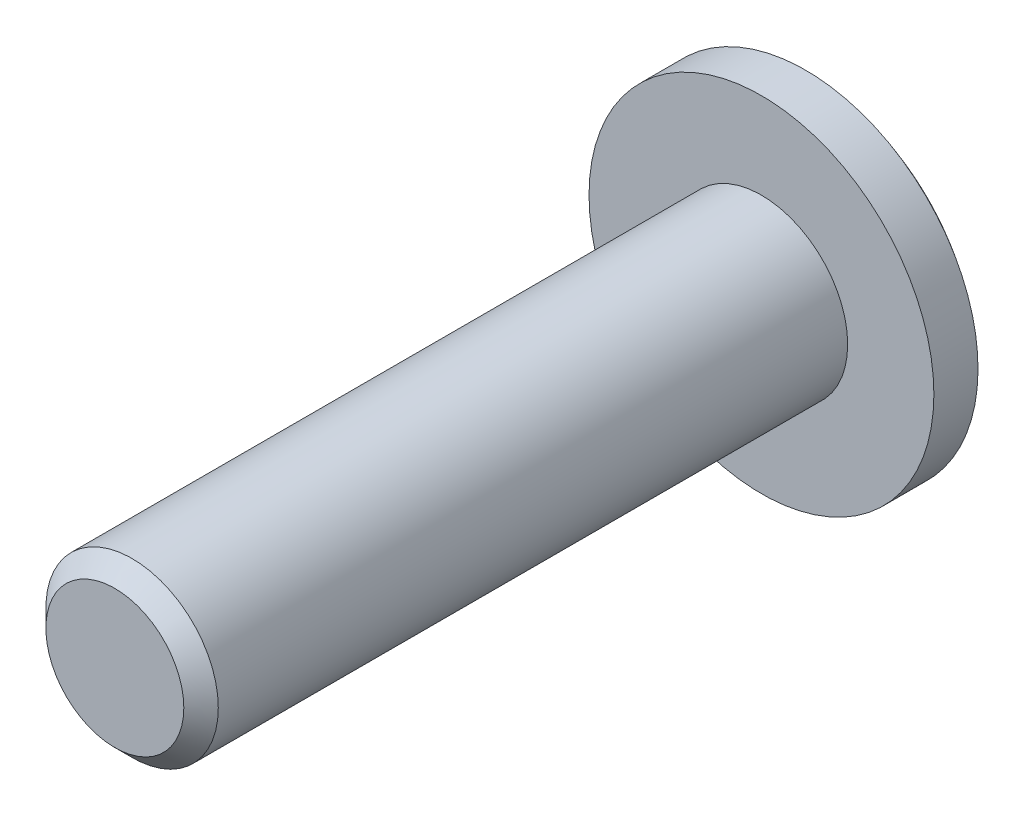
ISO-10303-21;
HEADER;
FILE_DESCRIPTION(('STEP AP214'),'2;1');
FILE_NAME('part.step','',(''),(''),'','','');
FILE_SCHEMA(('AUTOMOTIVE_DESIGN { 1 0 10303 214 1 1 1 1 }'));
ENDSEC;
DATA;
#1=APPLICATION_CONTEXT('core data for automotive mechanical design processes');
#2=APPLICATION_PROTOCOL_DEFINITION('international standard','automotive_design',2000,#1);
#3=PRODUCT_CONTEXT('',#1,'mechanical');
#4=PRODUCT('Part','Part','',(#3));
#5=PRODUCT_RELATED_PRODUCT_CATEGORY('part','',(#4));
#6=PRODUCT_DEFINITION_FORMATION('','',#4);
#7=PRODUCT_DEFINITION_CONTEXT('part definition',#1,'design');
#8=PRODUCT_DEFINITION('design','',#6,#7);
#9=PRODUCT_DEFINITION_SHAPE('','',#8);
#10=(LENGTH_UNIT() NAMED_UNIT(*) SI_UNIT(.MILLI.,.METRE.));
#11=(NAMED_UNIT(*) PLANE_ANGLE_UNIT() SI_UNIT($,.RADIAN.));
#12=(NAMED_UNIT(*) SI_UNIT($,.STERADIAN.) SOLID_ANGLE_UNIT());
#13=UNCERTAINTY_MEASURE_WITH_UNIT(LENGTH_MEASURE(1.E-05),#10,'distance_accuracy_value','');
#14=(GEOMETRIC_REPRESENTATION_CONTEXT(3) GLOBAL_UNCERTAINTY_ASSIGNED_CONTEXT((#13)) GLOBAL_UNIT_ASSIGNED_CONTEXT((#10,
#11,#12)) REPRESENTATION_CONTEXT('',''));
#15=CARTESIAN_POINT('',(0.,0.,0.));
#16=DIRECTION('',(0.,0.,1.));
#17=DIRECTION('',(1.,0.,0.));
#18=AXIS2_PLACEMENT_3D('',#15,#16,#17);
#19=CARTESIAN_POINT('',(0.,0.,8.2));
#20=DIRECTION('',(0.,0.,-1.));
#21=DIRECTION('',(1.,0.,0.));
#22=AXIS2_PLACEMENT_3D('',#19,#20,#21);
#23=SPHERICAL_SURFACE('',#22,13.);
#24=CARTESIAN_POINT('',(0.,0.,-2.0469507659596));
#25=DIRECTION('',(0.,0.,-1.));
#26=DIRECTION('',(-1.,0.,0.));
#27=AXIS2_PLACEMENT_3D('',#24,#25,#26);
#28=CIRCLE('',#27,8.);
#29=CARTESIAN_POINT('',(-8.,0.,-2.0469507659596));
#30=VERTEX_POINT('',#29);
#31=EDGE_CURVE('E109',#30,#30,#28,.T.);
#32=ORIENTED_EDGE('',*,*,#31,.T.);
#33=EDGE_LOOP('',(#32));
#34=FACE_BOUND('',#33,.T.);
#35=CARTESIAN_POINT('',(1.75,3.03108891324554,8.2));
#36=DIRECTION('',(-0.5,-0.866025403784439,0.));
#37=DIRECTION('',(0.866025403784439,-0.5,0.));
#38=AXIS2_PLACEMENT_3D('',#35,#36,#37);
#39=CIRCLE('',#38,12.5199840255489);
#40=CARTESIAN_POINT('',(0.,4.04145188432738,-4.15583532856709));
#41=VERTEX_POINT('',#40);
#42=CARTESIAN_POINT('',(3.5,2.02072594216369,-4.15583532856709));
#43=VERTEX_POINT('',#42);
#44=EDGE_CURVE('E126',#41,#43,#39,.T.);
#45=ORIENTED_EDGE('',*,*,#44,.F.);
#46=CARTESIAN_POINT('',(-1.75,3.03108891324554,8.2));
#47=DIRECTION('',(0.5,-0.866025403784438,0.));
#48=DIRECTION('',(0.866025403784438,0.5,0.));
#49=AXIS2_PLACEMENT_3D('',#46,#47,#48);
#50=CIRCLE('',#49,12.5199840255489);
#51=CARTESIAN_POINT('',(-3.5,2.02072594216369,-4.15583532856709));
#52=VERTEX_POINT('',#51);
#53=EDGE_CURVE('E57',#52,#41,#50,.T.);
#54=ORIENTED_EDGE('',*,*,#53,.F.);
#55=CARTESIAN_POINT('',(-3.5,0.,8.2));
#56=DIRECTION('',(1.,0.,0.));
#57=DIRECTION('',(0.,1.,0.));
#58=AXIS2_PLACEMENT_3D('',#55,#56,#57);
#59=CIRCLE('',#58,12.5199840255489);
#60=CARTESIAN_POINT('',(-3.5,-2.02072594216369,-4.15583532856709));
#61=VERTEX_POINT('',#60);
#62=EDGE_CURVE('E123',#61,#52,#59,.T.);
#63=ORIENTED_EDGE('',*,*,#62,.F.);
#64=CARTESIAN_POINT('',(-1.75,-3.03108891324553,8.2));
#65=DIRECTION('',(0.5,0.866025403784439,0.));
#66=DIRECTION('',(-0.866025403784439,0.5,0.));
#67=AXIS2_PLACEMENT_3D('',#64,#65,#66);
#68=CIRCLE('',#67,12.5199840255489);
#69=CARTESIAN_POINT('',(0.,-4.04145188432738,-4.15583532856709));
#70=VERTEX_POINT('',#69);
#71=EDGE_CURVE('E121',#70,#61,#68,.T.);
#72=ORIENTED_EDGE('',*,*,#71,.F.);
#73=CARTESIAN_POINT('',(1.75,-3.03108891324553,8.2));
#74=DIRECTION('',(-0.5,0.866025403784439,0.));
#75=DIRECTION('',(-0.866025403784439,-0.5,0.));
#76=AXIS2_PLACEMENT_3D('',#73,#74,#75);
#77=CIRCLE('',#76,12.5199840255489);
#78=CARTESIAN_POINT('',(3.5,-2.02072594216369,-4.15583532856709));
#79=VERTEX_POINT('',#78);
#80=EDGE_CURVE('E119',#79,#70,#77,.T.);
#81=ORIENTED_EDGE('',*,*,#80,.F.);
#82=CARTESIAN_POINT('',(3.5,0.,8.2));
#83=DIRECTION('',(-1.,0.,0.));
#84=DIRECTION('',(0.,-1.,0.));
#85=AXIS2_PLACEMENT_3D('',#82,#83,#84);
#86=CIRCLE('',#85,12.5199840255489);
#87=EDGE_CURVE('E117',#43,#79,#86,.T.);
#88=ORIENTED_EDGE('',*,*,#87,.F.);
#89=EDGE_LOOP('',(#45,#54,#63,#72,#81,#88));
#90=FACE_BOUND('',#89,.T.);
#91=ADVANCED_FACE('F34',(#34,#90),#23,.T.);
#92=CARTESIAN_POINT('',(0.,0.,0.));
#93=DIRECTION('',(0.,0.,-1.));
#94=DIRECTION('',(-1.,0.,0.));
#95=AXIS2_PLACEMENT_3D('',#92,#93,#94);
#96=CYLINDRICAL_SURFACE('',#95,8.);
#97=ORIENTED_EDGE('',*,*,#31,.F.);
#98=EDGE_LOOP('',(#97));
#99=FACE_BOUND('',#98,.T.);
#100=CARTESIAN_POINT('',(0.,0.,0.));
#101=DIRECTION('',(0.,0.,-1.));
#102=DIRECTION('',(-1.,0.,0.));
#103=AXIS2_PLACEMENT_3D('',#100,#101,#102);
#104=CIRCLE('',#103,8.);
#105=CARTESIAN_POINT('',(-8.,0.,0.));
#106=VERTEX_POINT('',#105);
#107=EDGE_CURVE('E105',#106,#106,#104,.T.);
#108=ORIENTED_EDGE('',*,*,#107,.T.);
#109=EDGE_LOOP('',(#108));
#110=FACE_BOUND('',#109,.T.);
#111=ADVANCED_FACE('F142',(#99,#110),#96,.T.);
#112=CARTESIAN_POINT('',(0.,0.,0.));
#113=DIRECTION('',(0.,0.,-1.));
#114=DIRECTION('',(-1.,0.,0.));
#115=AXIS2_PLACEMENT_3D('',#112,#113,#114);
#116=PLANE('',#115);
#117=CARTESIAN_POINT('',(0.,0.,0.));
#118=DIRECTION('',(0.,0.,1.));
#119=DIRECTION('',(1.,0.,0.));
#120=AXIS2_PLACEMENT_3D('',#117,#118,#119);
#121=CIRCLE('',#120,4.);
#122=CARTESIAN_POINT('',(4.,0.,0.));
#123=VERTEX_POINT('',#122);
#124=EDGE_CURVE('E102',#123,#123,#121,.T.);
#125=ORIENTED_EDGE('',*,*,#124,.F.);
#126=EDGE_LOOP('',(#125));
#127=FACE_BOUND('',#126,.T.);
#128=ORIENTED_EDGE('',*,*,#107,.F.);
#129=EDGE_LOOP('',(#128));
#130=FACE_BOUND('',#129,.T.);
#131=ADVANCED_FACE('F147',(#127,#130),#116,.F.);
#132=CARTESIAN_POINT('',(3.5,2.02072594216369,-2.));
#133=DIRECTION('',(-0.5,-0.866025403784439,0.));
#134=DIRECTION('',(0.866025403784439,-0.5,0.));
#135=AXIS2_PLACEMENT_3D('',#132,#133,#134);
#136=PLANE('',#135);
#137=ORIENTED_EDGE('',*,*,#44,.T.);
#138=DIRECTION('',(0.,0.,-1.));
#139=VECTOR('',#138,1.);
#140=CARTESIAN_POINT('',(3.5,2.02072594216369,-2.));
#141=LINE('',#140,#139);
#142=CARTESIAN_POINT('',(3.5,2.02072594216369,-2.));
#143=VERTEX_POINT('',#142);
#144=EDGE_CURVE('E49',#143,#43,#141,.T.);
#145=ORIENTED_EDGE('',*,*,#144,.F.);
#146=DIRECTION('',(-0.866025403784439,0.5,0.));
#147=VECTOR('',#146,1.);
#148=CARTESIAN_POINT('',(3.5,2.02072594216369,-2.));
#149=LINE('',#148,#147);
#150=CARTESIAN_POINT('',(0.,4.04145188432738,-2.));
#151=VERTEX_POINT('',#150);
#152=EDGE_CURVE('E93',#143,#151,#149,.T.);
#153=ORIENTED_EDGE('',*,*,#152,.T.);
#154=DIRECTION('',(0.,0.,-1.));
#155=VECTOR('',#154,1.);
#156=CARTESIAN_POINT('',(0.,4.04145188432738,-2.));
#157=LINE('',#156,#155);
#158=EDGE_CURVE('E100',#151,#41,#157,.T.);
#159=ORIENTED_EDGE('',*,*,#158,.T.);
#160=EDGE_LOOP('',(#137,#145,#153,#159));
#161=FACE_BOUND('',#160,.T.);
#162=ADVANCED_FACE('F99',(#161),#136,.T.);
#163=CARTESIAN_POINT('',(0.,4.04145188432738,-2.));
#164=DIRECTION('',(0.5,-0.866025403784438,0.));
#165=DIRECTION('',(0.866025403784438,0.5,0.));
#166=AXIS2_PLACEMENT_3D('',#163,#164,#165);
#167=PLANE('',#166);
#168=ORIENTED_EDGE('',*,*,#53,.T.);
#169=ORIENTED_EDGE('',*,*,#158,.F.);
#170=DIRECTION('',(-0.866025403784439,-0.5,0.));
#171=VECTOR('',#170,1.);
#172=CARTESIAN_POINT('',(0.,4.04145188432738,-2.));
#173=LINE('',#172,#171);
#174=CARTESIAN_POINT('',(-3.5,2.02072594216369,-2.));
#175=VERTEX_POINT('',#174);
#176=EDGE_CURVE('E89',#151,#175,#173,.T.);
#177=ORIENTED_EDGE('',*,*,#176,.T.);
#178=DIRECTION('',(0.,0.,-1.));
#179=VECTOR('',#178,1.);
#180=CARTESIAN_POINT('',(-3.5,2.02072594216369,-2.));
#181=LINE('',#180,#179);
#182=EDGE_CURVE('E106',#175,#52,#181,.T.);
#183=ORIENTED_EDGE('',*,*,#182,.T.);
#184=EDGE_LOOP('',(#168,#169,#177,#183));
#185=FACE_BOUND('',#184,.T.);
#186=ADVANCED_FACE('F104',(#185),#167,.T.);
#187=CARTESIAN_POINT('',(-3.5,2.02072594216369,-2.));
#188=DIRECTION('',(1.,0.,0.));
#189=DIRECTION('',(0.,1.,0.));
#190=AXIS2_PLACEMENT_3D('',#187,#188,#189);
#191=PLANE('',#190);
#192=ORIENTED_EDGE('',*,*,#62,.T.);
#193=ORIENTED_EDGE('',*,*,#182,.F.);
#194=DIRECTION('',(0.,-1.,0.));
#195=VECTOR('',#194,1.);
#196=CARTESIAN_POINT('',(-3.5,2.02072594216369,-2.));
#197=LINE('',#196,#195);
#198=CARTESIAN_POINT('',(-3.5,-2.02072594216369,-2.));
#199=VERTEX_POINT('',#198);
#200=EDGE_CURVE('E95',#175,#199,#197,.T.);
#201=ORIENTED_EDGE('',*,*,#200,.T.);
#202=DIRECTION('',(0.,0.,-1.));
#203=VECTOR('',#202,1.);
#204=CARTESIAN_POINT('',(-3.5,-2.02072594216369,-2.));
#205=LINE('',#204,#203);
#206=EDGE_CURVE('E111',#199,#61,#205,.T.);
#207=ORIENTED_EDGE('',*,*,#206,.T.);
#208=EDGE_LOOP('',(#192,#193,#201,#207));
#209=FACE_BOUND('',#208,.T.);
#210=ADVANCED_FACE('F159',(#209),#191,.T.);
#211=CARTESIAN_POINT('',(-3.5,-2.02072594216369,-2.));
#212=DIRECTION('',(0.5,0.866025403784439,0.));
#213=DIRECTION('',(-0.866025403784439,0.5,0.));
#214=AXIS2_PLACEMENT_3D('',#211,#212,#213);
#215=PLANE('',#214);
#216=ORIENTED_EDGE('',*,*,#71,.T.);
#217=ORIENTED_EDGE('',*,*,#206,.F.);
#218=DIRECTION('',(0.866025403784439,-0.5,0.));
#219=VECTOR('',#218,1.);
#220=CARTESIAN_POINT('',(-3.5,-2.02072594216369,-2.));
#221=LINE('',#220,#219);
#222=CARTESIAN_POINT('',(0.,-4.04145188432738,-2.));
#223=VERTEX_POINT('',#222);
#224=EDGE_CURVE('E272',#199,#223,#221,.T.);
#225=ORIENTED_EDGE('',*,*,#224,.T.);
#226=DIRECTION('',(0.,0.,-1.));
#227=VECTOR('',#226,1.);
#228=CARTESIAN_POINT('',(0.,-4.04145188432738,-2.));
#229=LINE('',#228,#227);
#230=EDGE_CURVE('E260',#223,#70,#229,.T.);
#231=ORIENTED_EDGE('',*,*,#230,.T.);
#232=EDGE_LOOP('',(#216,#217,#225,#231));
#233=FACE_BOUND('',#232,.T.);
#234=ADVANCED_FACE('F162',(#233),#215,.T.);
#235=CARTESIAN_POINT('',(0.,-4.04145188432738,-2.));
#236=DIRECTION('',(-0.5,0.866025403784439,0.));
#237=DIRECTION('',(-0.866025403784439,-0.5,0.));
#238=AXIS2_PLACEMENT_3D('',#235,#236,#237);
#239=PLANE('',#238);
#240=ORIENTED_EDGE('',*,*,#80,.T.);
#241=ORIENTED_EDGE('',*,*,#230,.F.);
#242=DIRECTION('',(0.866025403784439,0.5,0.));
#243=VECTOR('',#242,1.);
#244=CARTESIAN_POINT('',(0.,-4.04145188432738,-2.));
#245=LINE('',#244,#243);
#246=CARTESIAN_POINT('',(3.5,-2.02072594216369,-2.));
#247=VERTEX_POINT('',#246);
#248=EDGE_CURVE('E259',#223,#247,#245,.T.);
#249=ORIENTED_EDGE('',*,*,#248,.T.);
#250=DIRECTION('',(0.,0.,-1.));
#251=VECTOR('',#250,1.);
#252=CARTESIAN_POINT('',(3.5,-2.02072594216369,-2.));
#253=LINE('',#252,#251);
#254=EDGE_CURVE('E254',#247,#79,#253,.T.);
#255=ORIENTED_EDGE('',*,*,#254,.T.);
#256=EDGE_LOOP('',(#240,#241,#249,#255));
#257=FACE_BOUND('',#256,.T.);
#258=ADVANCED_FACE('F166',(#257),#239,.T.);
#259=CARTESIAN_POINT('',(3.5,-2.02072594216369,-2.));
#260=DIRECTION('',(-1.,0.,0.));
#261=DIRECTION('',(0.,-1.,0.));
#262=AXIS2_PLACEMENT_3D('',#259,#260,#261);
#263=PLANE('',#262);
#264=ORIENTED_EDGE('',*,*,#87,.T.);
#265=ORIENTED_EDGE('',*,*,#254,.F.);
#266=DIRECTION('',(0.,1.,0.));
#267=VECTOR('',#266,1.);
#268=CARTESIAN_POINT('',(3.5,-2.02072594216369,-2.));
#269=LINE('',#268,#267);
#270=EDGE_CURVE('E269',#247,#143,#269,.T.);
#271=ORIENTED_EDGE('',*,*,#270,.T.);
#272=ORIENTED_EDGE('',*,*,#144,.T.);
#273=EDGE_LOOP('',(#264,#265,#271,#272));
#274=FACE_BOUND('',#273,.T.);
#275=ADVANCED_FACE('F170',(#274),#263,.T.);
#276=CARTESIAN_POINT('',(0.,4.04145188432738,-2.));
#277=DIRECTION('',(0.,0.,1.));
#278=DIRECTION('',(1.,0.,0.));
#279=AXIS2_PLACEMENT_3D('',#276,#277,#278);
#280=PLANE('',#279);
#281=ORIENTED_EDGE('',*,*,#152,.F.);
#282=ORIENTED_EDGE('',*,*,#270,.F.);
#283=ORIENTED_EDGE('',*,*,#248,.F.);
#284=ORIENTED_EDGE('',*,*,#224,.F.);
#285=ORIENTED_EDGE('',*,*,#200,.F.);
#286=ORIENTED_EDGE('',*,*,#176,.F.);
#287=EDGE_LOOP('',(#281,#282,#283,#284,#285,#286));
#288=FACE_BOUND('',#287,.T.);
#289=ADVANCED_FACE('F91',(#288),#280,.F.);
#290=CARTESIAN_POINT('',(0.,0.,30.));
#291=DIRECTION('',(0.,0.,1.));
#292=DIRECTION('',(1.,0.,0.));
#293=AXIS2_PLACEMENT_3D('',#290,#291,#292);
#294=PLANE('',#293);
#295=CARTESIAN_POINT('',(0.,0.,30.));
#296=DIRECTION('',(0.,0.,1.));
#297=DIRECTION('',(1.,0.,0.));
#298=AXIS2_PLACEMENT_3D('',#295,#296,#297);
#299=CIRCLE('',#298,3.20000000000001);
#300=CARTESIAN_POINT('',(3.20000000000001,0.,30.));
#301=VERTEX_POINT('',#300);
#302=EDGE_CURVE('E42',#301,#301,#299,.T.);
#303=ORIENTED_EDGE('',*,*,#302,.T.);
#304=EDGE_LOOP('',(#303));
#305=FACE_BOUND('',#304,.T.);
#306=ADVANCED_FACE('F130',(#305),#294,.T.);
#307=CARTESIAN_POINT('',(0.,0.,0.));
#308=DIRECTION('',(0.,0.,1.));
#309=DIRECTION('',(1.,0.,0.));
#310=AXIS2_PLACEMENT_3D('',#307,#308,#309);
#311=CYLINDRICAL_SURFACE('',#310,4.);
#312=CARTESIAN_POINT('',(0.,0.,29.2));
#313=DIRECTION('',(0.,0.,1.));
#314=DIRECTION('',(1.,0.,0.));
#315=AXIS2_PLACEMENT_3D('',#312,#313,#314);
#316=CIRCLE('',#315,4.);
#317=CARTESIAN_POINT('',(4.,0.,29.2));
#318=VERTEX_POINT('',#317);
#319=EDGE_CURVE('E11',#318,#318,#316,.F.);
#320=ORIENTED_EDGE('',*,*,#319,.T.);
#321=EDGE_LOOP('',(#320));
#322=FACE_BOUND('',#321,.T.);
#323=ORIENTED_EDGE('',*,*,#124,.T.);
#324=EDGE_LOOP('',(#323));
#325=FACE_BOUND('',#324,.T.);
#326=ADVANCED_FACE('F133',(#322,#325),#311,.T.);
#327=CARTESIAN_POINT('',(0.,0.,30.));
#328=DIRECTION('',(0.,0.,-1.));
#329=DIRECTION('',(-1.,0.,0.));
#330=AXIS2_PLACEMENT_3D('',#327,#328,#329);
#331=CONICAL_SURFACE('',#330,3.20000000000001,0.785398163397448);
#332=ORIENTED_EDGE('',*,*,#319,.F.);
#333=EDGE_LOOP('',(#332));
#334=FACE_BOUND('',#333,.T.);
#335=ORIENTED_EDGE('',*,*,#302,.F.);
#336=EDGE_LOOP('',(#335));
#337=FACE_BOUND('',#336,.T.);
#338=ADVANCED_FACE('F36',(#334,#337),#331,.T.);
#339=CLOSED_SHELL('',(#91,#111,#131,#162,#186,#210,#234,#258,#275,#289,#306,#326,#338));
#340=MANIFOLD_SOLID_BREP('B2',#339);
#341=ADVANCED_BREP_SHAPE_REPRESENTATION('',(#18,#340),#14);
#342=SHAPE_DEFINITION_REPRESENTATION(#9,#341);
ENDSEC;
END-ISO-10303-21;
